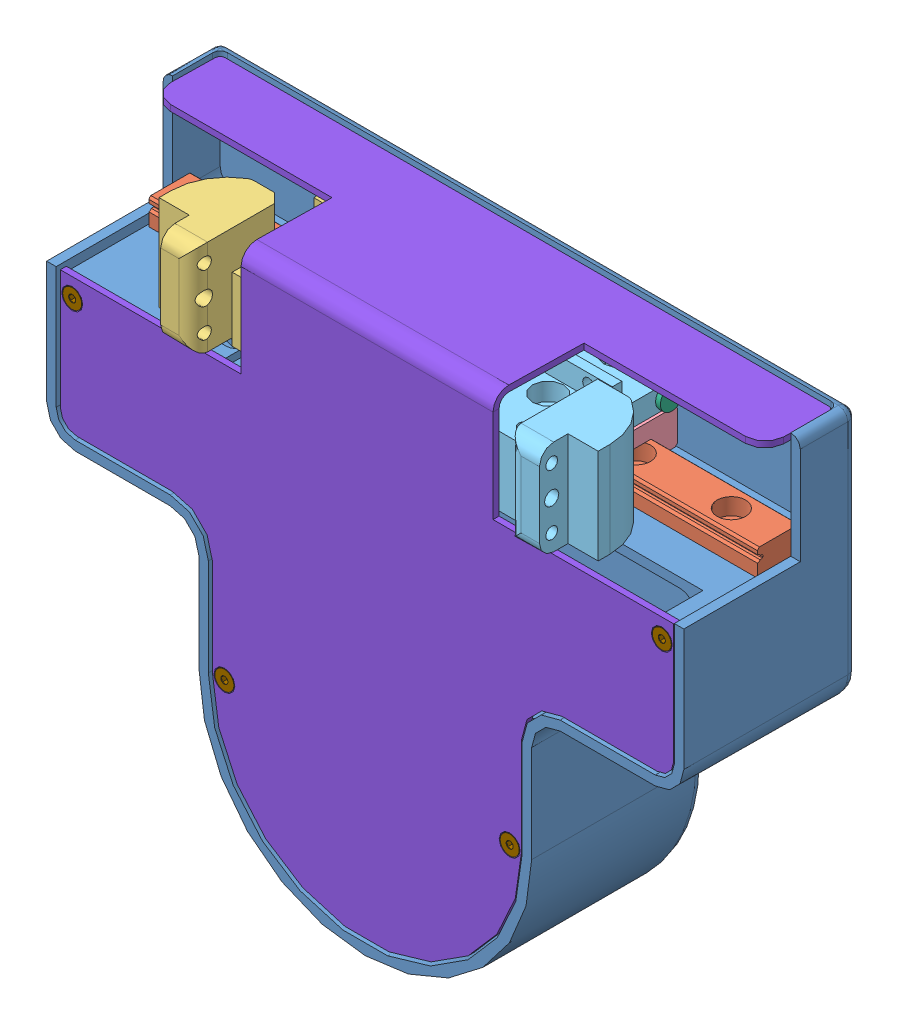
SolidWorks assembly Assy, Gripper, Precise, Rev2, PF400, ShellEXT.SLDASM, configuration Default (file format 9000). Lengths in mm.
Overall size (134 115.5 39.69).
15 component instances, 9 part files, 35 mates.
Components (placement in the parent):
- Gripper Frame, Precise, ShellEXT, PF400-1: Gripper Frame, Precise, ShellEXT, PF400.SLDPRT [Default] at origin size (134 115.5 36.5)
- IKO ML9 rail, 60mm, High Inspection-1: IKO ML9 rail, 60mm, High Inspection.SLDPRT [Default] at (14 56.0023 13.5) size (60 6 9)
- IKO ML9 rail, 60mm, High Inspection-2: IKO ML9 rail, 60mm, High Inspection.SLDPRT [Default] at (-54 56.0023 13.5) size (60 6 9)
- Finger Mount, Left, Spring, Rev2, PF400, ShellEXT-1: Finger Mount, Left, Spring, Rev2, PF400, ShellEXT.SLDPRT [Default] at (-2.9688 66.0023 23.5) x (0 1 0) z (1 0 0) size (21.57 36.69 43.21)
- IKO ML9 Slider High Inspection-3: IKO ML9 Slider High Inspection.SLDPRT [Default] at (37.9688 56.0023 13.5) x (-1 0 0) z (0 0 -1) size (30 8 20)
- IKO ML9 Slider High Inspection-4: IKO ML9 Slider High Inspection.SLDPRT [Default] at (2.0312 56.0023 13.5) x (-1 0 0) z (0 0 -1) size (30 8 20)
- Finger Mount, Right, Spring, Rev2, PF400, ShellEXT-1: Finger Mount, Right, Spring, Rev2, PF400, ShellEXT.SLDPRT [Default] at (2.9688 66.0023 23.5) x (0 -1 0) z (-1 0 0) size (22 37.19 43.21)
- Bumper, 602-034-1: Bumper, 602-034.SLDPRT [Default] at (-30.5687 68.2523 6.5) x (0 1 0) z (0 0 1) size (4.8 3.4 4.8)
- Bumper, 602-034-2: Bumper, 602-034.SLDPRT [Default] at (30.5687 68.3023 6) x (0 -1 0) z (0 0 1) size (4.8 3.4 4.8)
- Bumper, MMC 93115K71-1: Bumper, MMC 93115K71.SLDPRT [Default] at (8.1281 67.4383 27.5) x (0 1 0) z (0 0 1) size (7.14 13.1 7.14)
- Cover, Gripper, Precise, PF400, ShellEXT-1: Cover, Gripper, Precise, PF400, ShellEXT.SLDPRT [Default] at (0 0 34.857) size (129 112.84 33.64)
- M2-6 FHCS-1: M2-6 FHCS.SLDPRT [92125A052] at (-62 53.5 30.127) x (-0.923728 -0.383049 0) z (0 0 -1) size (4 4 6.07)
- M2-6 FHCS-2: M2-6 FHCS.SLDPRT [92125A052] at (-30 0 30.127) x (-0.923728 -0.383049 0) z (0 0 -1) size (4 4 6.07)
- M2-6 FHCS-3: M2-6 FHCS.SLDPRT [92125A052] at (30 0 30.127) x (-0.923728 -0.383049 0) z (0 0 -1) size (4 4 6.07)
- M2-6 FHCS-4: M2-6 FHCS.SLDPRT [92125A052] at (62 53.5 30.127) x (-0.923728 -0.383049 0) z (0 0 -1) size (4 4 6.07)
Mates (geometry in assembly coordinates):
- Gripper Distance (0-60mm): distance anti-aligned: plane of Bumper, MMC 93115K71-1 through (-4.9688 67.4383 27.5) normal (-1 0 0); plane of Finger Mount, Left, Spring, Rev2, PF400, ShellEXT-1 through (-4.9688 66.0023 23.5) normal (1 0 0)
- Concentric1: concentric anti-aligned: cylinder of Gripper Frame, Precise, ShellEXT, PF400-1 through (54 56.0023 13.5) axis (0 1 0) radius 1.25; cylinder of IKO ML9 rail, 60mm, High Inspection-1 through (54 57.3523 13.5) axis (0 -1 0) radius 1.75
- Concentric2: concentric anti-aligned: cylinder of Gripper Frame, Precise, ShellEXT, PF400-1 through (14 56.0023 13.5) axis (0 1 0) radius 1.25; cylinder of IKO ML9 rail, 60mm, High Inspection-1 through (14 57.3523 13.5) axis (0 -1 0) radius 1.75
- Coincident1: coincident anti-aligned: plane of Gripper Frame, Precise, ShellEXT, PF400-1 through (-65 56.0023 -156.4258) normal (0 1 0); plane of IKO ML9 rail, 60mm, High Inspection-1 through (4 56.0023 9.5) normal (0 -1 0)
- Concentric3: concentric anti-aligned: cylinder of Gripper Frame, Precise, ShellEXT, PF400-1 through (-14 56.0023 13.5) axis (0 1 0) radius 1.25; cylinder of IKO ML9 rail, 60mm, High Inspection-2 through (-14 57.3523 13.5) axis (0 -1 0) radius 1.75
- Concentric4: concentric anti-aligned: cylinder of Gripper Frame, Precise, ShellEXT, PF400-1 through (-54 56.0023 13.5) axis (0 1 0) radius 1.25; cylinder of IKO ML9 rail, 60mm, High Inspection-2 through (-54 57.3523 13.5) axis (0 -1 0) radius 1.75
- Coincident2: coincident anti-aligned: plane of Gripper Frame, Precise, ShellEXT, PF400-1 through (-65 56.0023 -156.4258) normal (0 1 0); plane of IKO ML9 rail, 60mm, High Inspection-2 through (-64 56.0023 9.5) normal (0 -1 0)
- Concentric9: concentric anti-aligned: cylinder of IKO ML9 rail, 60mm, High Inspection-2 through (-64 60.0023 18.15) axis (-1 0 0) radius 0.79; cylinder of IKO ML9 Slider High Inspection-4 through (-2.9688 60.0023 18.15) axis (1 0 0) radius 0.7938
- Concentric10: concentric anti-aligned: cylinder of IKO ML9 rail, 60mm, High Inspection-2 through (-64 60.0023 8.85) axis (-1 0 0) radius 0.79; cylinder of IKO ML9 Slider High Inspection-4 through (-2.9688 60.0023 8.85) axis (1 0 0) radius 0.7938
- Concentric11: concentric anti-aligned: cylinder of IKO ML9 rail, 60mm, High Inspection-1 through (4 60.0023 18.15) axis (-1 0 0) radius 0.79; cylinder of IKO ML9 Slider High Inspection-3 through (32.9688 60.0023 18.15) axis (1 0 0) radius 0.7938
- Concentric12: concentric anti-aligned: cylinder of IKO ML9 rail, 60mm, High Inspection-1 through (4 60.0023 8.85) axis (-1 0 0) radius 0.79; cylinder of IKO ML9 Slider High Inspection-3 through (32.9688 60.0023 8.85) axis (1 0 0) radius 0.7938
- Concentric13: concentric anti-aligned: cylinder of Finger Mount, Left, Spring, Rev2, PF400, ShellEXT-1 through (-12.9688 71.1023 21) axis (0 1 0) radius 1.7; cylinder of IKO ML9 Slider High Inspection-4 through (-12.9688 63.847 21) axis (0 -1 0) radius 1.2295
- Concentric14: concentric anti-aligned: cylinder of Finger Mount, Left, Spring, Rev2, PF400, ShellEXT-1 through (-22.9688 71.1023 21) axis (0 1 0) radius 1.7; cylinder of IKO ML9 Slider High Inspection-4 through (-22.9688 63.847 21) axis (0 -1 0) radius 1.2295
- Coincident4: coincident anti-aligned: plane of Finger Mount, Left, Spring, Rev2, PF400, ShellEXT-1 through (-32.9688 66.0023 3) normal (0 -1 0); plane of IKO ML9 Slider High Inspection-4 through (-2.9688 66.0023 18.5) normal (0 1 0)
- Concentric15: concentric anti-aligned: cylinder of IKO ML9 Slider High Inspection-3 through (12.9688 63.847 21) axis (0 -1 0) radius 1.2295; cylinder of Finger Mount, Right, Spring, Rev2, PF400, ShellEXT-1 through (12.9688 71.1023 21) axis (0 1 0) radius 3.25
- Concentric16: concentric anti-aligned: cylinder of IKO ML9 Slider High Inspection-3 through (22.9688 63.847 21) axis (0 -1 0) radius 1.2295; cylinder of Finger Mount, Right, Spring, Rev2, PF400, ShellEXT-1 through (22.9688 71.1023 21) axis (0 1 0) radius 3.25
- Coincident5: coincident anti-aligned: plane of IKO ML9 Slider High Inspection-3 through (32.9688 66.0023 18.5) normal (0 1 0); plane of Finger Mount, Right, Spring, Rev2, PF400, ShellEXT-1 through (32.9688 66.0023 2.5) normal (0 -1 0)
- Concentric171: concentric anti-aligned: cylinder of Finger Mount, Left, Spring, Rev2, PF400, ShellEXT-1 through (-29.9688 68.2523 6.5) axis (-1 0 0) radius 1.6; cylinder of Bumper, 602-034-1 through (-30.5687 68.2523 6.5) axis (1 0 0) radius 1.6
- Coincident61: coincident anti-aligned: plane of Finger Mount, Left, Spring, Rev2, PF400, ShellEXT-1 through (-32.9688 66.0023 23.5) normal (-1 0 0); plane of Bumper, 602-034-1 through (-32.9688 70.6523 6.5) normal (1 0 0)
- Concentric181: concentric anti-aligned: cylinder of Finger Mount, Right, Spring, Rev2, PF400, ShellEXT-1 through (29.9688 68.3023 6) axis (1 0 0) radius 1.6; cylinder of Bumper, 602-034-2 through (30.5687 68.3023 6) axis (-1 0 0) radius 1.6
- Coincident71: coincident anti-aligned: plane of Finger Mount, Right, Spring, Rev2, PF400, ShellEXT-1 through (32.9688 66.0023 23.5) normal (1 0 0); plane of Bumper, 602-034-2 through (32.9688 65.9023 6) normal (-1 0 0)
- Concentric19: concentric anti-aligned: cylinder of Finger Mount, Right, Spring, Rev2, PF400, ShellEXT-1 through (2.9688 67.4383 27.5) axis (-1 0 0) radius 1.1303; cylinder of Bumper, MMC 93115K71-1 through (8.1281 67.4383 27.5) axis (1 0 0) radius 1.4224
- Coincident8: coincident anti-aligned: plane of Finger Mount, Right, Spring, Rev2, PF400, ShellEXT-1 through (2.9688 66.0023 23.5) normal (-1 0 0); plane of Bumper, MMC 93115K71-1 through (2.9688 71.0102 27.5) normal (1 0 0)
- Width6: width = 7.6422 mm anti-aligned: plane of Gripper Frame, Precise, ShellEXT, PF400-1 through (-67 32.4095 36.5) normal (-1 0 0); plane of Gripper Frame, Precise, ShellEXT, PF400-1 through (67 32.4095 36.5) normal (1 0 0); plane of Finger Mount, Left, Spring, Rev2, PF400, ShellEXT-1 through (-39.8288 78.5733 39.69) normal (-1 0 0); plane of Finger Mount, Right, Spring, Rev2, PF400, ShellEXT-1 through (39.8288 78.5733 33.69) normal (1 0 0)
- Concentric20: concentric aligned: cylinder of Gripper Frame, Precise, ShellEXT, PF400-1 through (-62 53.5 34.857) axis (0 0 1) radius 0.8; cylinder of Cover, Gripper, Precise, PF400, ShellEXT-1 through (-62 53.5 36.127) axis (0 0 1) radius 1.2
- Concentric21: concentric aligned: cylinder of Gripper Frame, Precise, ShellEXT, PF400-1 through (-30 0 34.857) axis (0 0 1) radius 0.8; cylinder of Cover, Gripper, Precise, PF400, ShellEXT-1 through (-30 0 36.127) axis (0 0 1) radius 1.2
- Coincident10: coincident anti-aligned: plane of Gripper Frame, Precise, ShellEXT, PF400-1 through (0 0 34.857) normal (0 0 1); plane of Cover, Gripper, Precise, PF400, ShellEXT-1 through (0 0 34.857) normal (0 0 -1)
- Concentric22: concentric anti-aligned: cylinder of Gripper Frame, Precise, ShellEXT, PF400-1 through (62 53.5 34.857) axis (0 0 1) radius 0.8; cylinder of M2-6 FHCS-4 through (62 53.5 36.127) axis (0 0 -1) radius 1
- Coincident11: coincident aligned: plane of Cover, Gripper, Precise, PF400, ShellEXT-1 through (0 0 36.127) normal (0 0 1); plane of M2-6 FHCS-4 through (62 53.5 36.127) normal (0 0 1)
- Concentric23: concentric anti-aligned: cylinder of Gripper Frame, Precise, ShellEXT, PF400-1 through (-62 53.5 34.857) axis (0 0 1) radius 0.8; cylinder of M2-6 FHCS-1 through (-62 53.5 36.127) axis (0 0 -1) radius 1
- Coincident12: coincident aligned: plane of Cover, Gripper, Precise, PF400, ShellEXT-1 through (0 0 36.127) normal (0 0 1); plane of M2-6 FHCS-1 through (-62 53.5 36.127) normal (0 0 1)
- Concentric24: concentric anti-aligned: cylinder of Gripper Frame, Precise, ShellEXT, PF400-1 through (-30 0 34.857) axis (0 0 1) radius 0.8; cylinder of M2-6 FHCS-2 through (-30 0 36.127) axis (0 0 -1) radius 1
- Coincident13: coincident aligned: plane of Cover, Gripper, Precise, PF400, ShellEXT-1 through (0 0 36.127) normal (0 0 1); plane of M2-6 FHCS-2 through (-30 0 36.127) normal (0 0 1)
- Concentric25: concentric anti-aligned: cylinder of Gripper Frame, Precise, ShellEXT, PF400-1 through (30 0 34.857) axis (0 0 1) radius 0.8; cylinder of M2-6 FHCS-3 through (30 0 36.127) axis (0 0 -1) radius 1
- Coincident14: coincident aligned: plane of Cover, Gripper, Precise, PF400, ShellEXT-1 through (0 0 36.127) normal (0 0 1); plane of M2-6 FHCS-3 through (30 0 36.127) normal (0 0 1)
